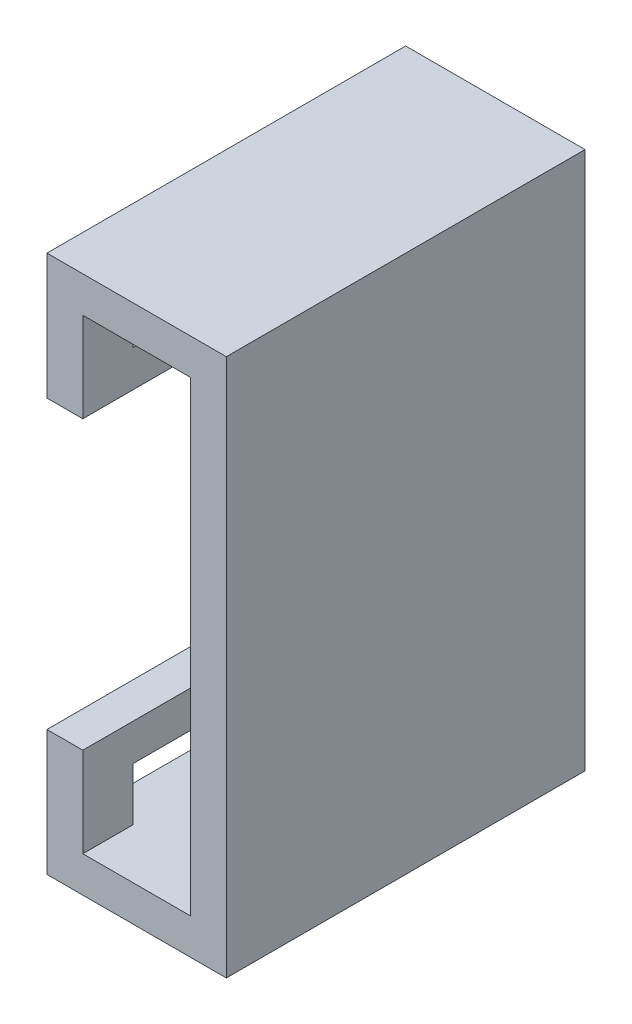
ISO-10303-21;
HEADER;
FILE_DESCRIPTION(('STEP AP214'),'2;1');
FILE_NAME('part.step','',(''),(''),'','','');
FILE_SCHEMA(('AUTOMOTIVE_DESIGN { 1 0 10303 214 1 1 1 1 }'));
ENDSEC;
DATA;
#1=APPLICATION_CONTEXT('core data for automotive mechanical design processes');
#2=APPLICATION_PROTOCOL_DEFINITION('international standard','automotive_design',2000,#1);
#3=PRODUCT_CONTEXT('',#1,'mechanical');
#4=PRODUCT('Part','Part','',(#3));
#5=PRODUCT_RELATED_PRODUCT_CATEGORY('part','',(#4));
#6=PRODUCT_DEFINITION_FORMATION('','',#4);
#7=PRODUCT_DEFINITION_CONTEXT('part definition',#1,'design');
#8=PRODUCT_DEFINITION('design','',#6,#7);
#9=PRODUCT_DEFINITION_SHAPE('','',#8);
#10=(LENGTH_UNIT() NAMED_UNIT(*) SI_UNIT(.MILLI.,.METRE.));
#11=(NAMED_UNIT(*) PLANE_ANGLE_UNIT() SI_UNIT($,.RADIAN.));
#12=(NAMED_UNIT(*) SI_UNIT($,.STERADIAN.) SOLID_ANGLE_UNIT());
#13=UNCERTAINTY_MEASURE_WITH_UNIT(LENGTH_MEASURE(1.E-05),#10,'distance_accuracy_value','');
#14=(GEOMETRIC_REPRESENTATION_CONTEXT(3) GLOBAL_UNCERTAINTY_ASSIGNED_CONTEXT((#13)) GLOBAL_UNIT_ASSIGNED_CONTEXT((#10,
#11,#12)) REPRESENTATION_CONTEXT('',''));
#15=CARTESIAN_POINT('',(0.,0.,0.));
#16=DIRECTION('',(0.,0.,1.));
#17=DIRECTION('',(1.,0.,0.));
#18=AXIS2_PLACEMENT_3D('',#15,#16,#17);
#19=CARTESIAN_POINT('',(1.,-6.5,17.));
#20=DIRECTION('',(1.,0.,0.));
#21=DIRECTION('',(0.,0.,-1.));
#22=AXIS2_PLACEMENT_3D('',#19,#20,#21);
#23=PLANE('',#22);
#24=DIRECTION('',(0.,0.,1.));
#25=VECTOR('',#24,1.);
#26=CARTESIAN_POINT('',(1.,5.02441072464,20.66470599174));
#27=LINE('',#26,#25);
#28=CARTESIAN_POINT('',(1.,5.02441072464,22.5));
#29=VERTEX_POINT('',#28);
#30=CARTESIAN_POINT('',(1.,5.02441072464,20.66470599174));
#31=VERTEX_POINT('',#30);
#32=EDGE_CURVE('E187',#29,#31,#27,.F.);
#33=ORIENTED_EDGE('',*,*,#32,.F.);
#34=DIRECTION('',(0.,1.,0.));
#35=VECTOR('',#34,1.);
#36=CARTESIAN_POINT('',(1.,0.,22.5));
#37=LINE('',#36,#35);
#38=CARTESIAN_POINT('',(1.,6.5,22.5));
#39=VERTEX_POINT('',#38);
#40=EDGE_CURVE('E220',#39,#29,#37,.F.);
#41=ORIENTED_EDGE('',*,*,#40,.F.);
#42=DIRECTION('',(0.,0.,1.));
#43=VECTOR('',#42,1.);
#44=CARTESIAN_POINT('',(1.,6.5,17.));
#45=LINE('',#44,#43);
#46=CARTESIAN_POINT('',(1.,6.5,20.66470599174));
#47=VERTEX_POINT('',#46);
#48=EDGE_CURVE('E190',#39,#47,#45,.F.);
#49=ORIENTED_EDGE('',*,*,#48,.T.);
#50=DIRECTION('',(0.,1.,0.));
#51=VECTOR('',#50,1.);
#52=CARTESIAN_POINT('',(1.,5.02441072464,20.66470599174));
#53=LINE('',#52,#51);
#54=EDGE_CURVE('E185',#47,#31,#53,.F.);
#55=ORIENTED_EDGE('',*,*,#54,.T.);
#56=EDGE_LOOP('',(#33,#41,#49,#55));
#57=FACE_BOUND('',#56,.T.);
#58=ADVANCED_FACE('F17',(#57),#23,.F.);
#59=CARTESIAN_POINT('',(1.,-6.5,17.));
#60=DIRECTION('',(1.,0.,0.));
#61=DIRECTION('',(0.,0.,-1.));
#62=AXIS2_PLACEMENT_3D('',#59,#60,#61);
#63=PLANE('',#62);
#64=DIRECTION('',(0.,1.,0.));
#65=VECTOR('',#64,1.);
#66=CARTESIAN_POINT('',(1.,5.02441072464,20.66470599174));
#67=LINE('',#66,#65);
#68=CARTESIAN_POINT('',(1.,-5.02441072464,20.66470599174));
#69=VERTEX_POINT('',#68);
#70=CARTESIAN_POINT('',(1.,-6.5,20.66470599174));
#71=VERTEX_POINT('',#70);
#72=EDGE_CURVE('E353',#69,#71,#67,.F.);
#73=ORIENTED_EDGE('',*,*,#72,.T.);
#74=DIRECTION('',(0.,0.,-1.));
#75=VECTOR('',#74,1.);
#76=CARTESIAN_POINT('',(1.,-6.5,17.));
#77=LINE('',#76,#75);
#78=CARTESIAN_POINT('',(1.,-6.5,22.5));
#79=VERTEX_POINT('',#78);
#80=EDGE_CURVE('E320',#71,#79,#77,.F.);
#81=ORIENTED_EDGE('',*,*,#80,.T.);
#82=DIRECTION('',(0.,1.,0.));
#83=VECTOR('',#82,1.);
#84=CARTESIAN_POINT('',(1.,0.,22.5));
#85=LINE('',#84,#83);
#86=CARTESIAN_POINT('',(1.,-5.02441072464,22.5));
#87=VERTEX_POINT('',#86);
#88=EDGE_CURVE('E217',#87,#79,#85,.F.);
#89=ORIENTED_EDGE('',*,*,#88,.F.);
#90=DIRECTION('',(0.,0.,1.));
#91=VECTOR('',#90,1.);
#92=CARTESIAN_POINT('',(1.,-5.02441072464,20.66470599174));
#93=LINE('',#92,#91);
#94=EDGE_CURVE('E179',#87,#69,#93,.F.);
#95=ORIENTED_EDGE('',*,*,#94,.T.);
#96=EDGE_LOOP('',(#73,#81,#89,#95));
#97=FACE_BOUND('',#96,.T.);
#98=ADVANCED_FACE('F372',(#97),#63,.F.);
#99=CARTESIAN_POINT('',(0.,0.,19.));
#100=DIRECTION('',(0.,0.,1.));
#101=DIRECTION('',(1.,0.,0.));
#102=AXIS2_PLACEMENT_3D('',#99,#100,#101);
#103=PLANE('',#102);
#104=DIRECTION('',(0.,1.,0.));
#105=VECTOR('',#104,1.);
#106=CARTESIAN_POINT('',(1.,-6.5,19.));
#107=LINE('',#106,#105);
#108=CARTESIAN_POINT('',(1.,6.5,19.));
#109=VERTEX_POINT('',#108);
#110=CARTESIAN_POINT('',(1.,-6.5,19.));
#111=VERTEX_POINT('',#110);
#112=EDGE_CURVE('E291',#109,#111,#107,.F.);
#113=ORIENTED_EDGE('',*,*,#112,.F.);
#114=DIRECTION('',(1.,0.,0.));
#115=VECTOR('',#114,1.);
#116=CARTESIAN_POINT('',(4.,6.5,19.));
#117=LINE('',#116,#115);
#118=CARTESIAN_POINT('',(4.,6.5,19.));
#119=VERTEX_POINT('',#118);
#120=EDGE_CURVE('E244',#109,#119,#117,.T.);
#121=ORIENTED_EDGE('',*,*,#120,.T.);
#122=DIRECTION('',(0.,1.,0.));
#123=VECTOR('',#122,1.);
#124=CARTESIAN_POINT('',(4.,6.5,19.));
#125=LINE('',#124,#123);
#126=CARTESIAN_POINT('',(4.,-6.5,19.));
#127=VERTEX_POINT('',#126);
#128=EDGE_CURVE('E301',#127,#119,#125,.T.);
#129=ORIENTED_EDGE('',*,*,#128,.F.);
#130=DIRECTION('',(1.,0.,0.));
#131=VECTOR('',#130,1.);
#132=CARTESIAN_POINT('',(1.,-6.5,19.));
#133=LINE('',#132,#131);
#134=EDGE_CURVE('E296',#127,#111,#133,.F.);
#135=ORIENTED_EDGE('',*,*,#134,.T.);
#136=EDGE_LOOP('',(#113,#121,#129,#135));
#137=FACE_BOUND('',#136,.T.);
#138=ADVANCED_FACE('F650',(#137),#103,.F.);
#139=CARTESIAN_POINT('',(1.5211596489,4.,27.));
#140=DIRECTION('',(0.,-1.,0.));
#141=DIRECTION('',(0.,0.,-1.));
#142=AXIS2_PLACEMENT_3D('',#139,#140,#141);
#143=PLANE('',#142);
#144=DIRECTION('',(0.,0.,-1.));
#145=VECTOR('',#144,1.);
#146=CARTESIAN_POINT('',(1.,4.,17.));
#147=LINE('',#146,#145);
#148=CARTESIAN_POINT('',(1.,4.,27.));
#149=VERTEX_POINT('',#148);
#150=CARTESIAN_POINT('',(1.,4.,22.5));
#151=VERTEX_POINT('',#150);
#152=EDGE_CURVE('E231',#149,#151,#147,.T.);
#153=ORIENTED_EDGE('',*,*,#152,.F.);
#154=DIRECTION('',(1.,0.,0.));
#155=VECTOR('',#154,1.);
#156=CARTESIAN_POINT('',(1.5211596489,4.,27.));
#157=LINE('',#156,#155);
#158=CARTESIAN_POINT('',(0.,4.,27.));
#159=VERTEX_POINT('',#158);
#160=EDGE_CURVE('E20',#149,#159,#157,.F.);
#161=ORIENTED_EDGE('',*,*,#160,.T.);
#162=DIRECTION('',(0.,0.,-1.));
#163=VECTOR('',#162,1.);
#164=CARTESIAN_POINT('',(0.,4.,17.));
#165=LINE('',#164,#163);
#166=CARTESIAN_POINT('',(0.,4.,22.5));
#167=VERTEX_POINT('',#166);
#168=EDGE_CURVE('E230',#159,#167,#165,.T.);
#169=ORIENTED_EDGE('',*,*,#168,.T.);
#170=DIRECTION('',(1.,0.,0.));
#171=VECTOR('',#170,1.);
#172=CARTESIAN_POINT('',(0.,4.,22.5));
#173=LINE('',#172,#171);
#174=EDGE_CURVE('E219',#151,#167,#173,.F.);
#175=ORIENTED_EDGE('',*,*,#174,.F.);
#176=EDGE_LOOP('',(#153,#161,#169,#175));
#177=FACE_BOUND('',#176,.T.);
#178=ADVANCED_FACE('F228',(#177),#143,.T.);
#179=CARTESIAN_POINT('',(0.,0.,22.5));
#180=DIRECTION('',(0.,0.,1.));
#181=DIRECTION('',(1.,0.,0.));
#182=AXIS2_PLACEMENT_3D('',#179,#180,#181);
#183=PLANE('',#182);
#184=ORIENTED_EDGE('',*,*,#88,.T.);
#185=DIRECTION('',(1.,0.,0.));
#186=VECTOR('',#185,1.);
#187=CARTESIAN_POINT('',(1.,-6.5,22.5));
#188=LINE('',#187,#186);
#189=CARTESIAN_POINT('',(4.,-6.5,22.5));
#190=VERTEX_POINT('',#189);
#191=EDGE_CURVE('E317',#79,#190,#188,.T.);
#192=ORIENTED_EDGE('',*,*,#191,.T.);
#193=DIRECTION('',(0.,1.,0.));
#194=VECTOR('',#193,1.);
#195=CARTESIAN_POINT('',(4.,6.5,22.5));
#196=LINE('',#195,#194);
#197=CARTESIAN_POINT('',(4.,6.5,22.5));
#198=VERTEX_POINT('',#197);
#199=EDGE_CURVE('E331',#198,#190,#196,.F.);
#200=ORIENTED_EDGE('',*,*,#199,.F.);
#201=DIRECTION('',(1.,0.,0.));
#202=VECTOR('',#201,1.);
#203=CARTESIAN_POINT('',(4.,6.5,22.5));
#204=LINE('',#203,#202);
#205=EDGE_CURVE('E337',#198,#39,#204,.F.);
#206=ORIENTED_EDGE('',*,*,#205,.T.);
#207=ORIENTED_EDGE('',*,*,#40,.T.);
#208=DIRECTION('',(0.,1.,0.));
#209=VECTOR('',#208,1.);
#210=CARTESIAN_POINT('',(1.,-6.5,22.5));
#211=LINE('',#210,#209);
#212=EDGE_CURVE('E347',#151,#29,#211,.T.);
#213=ORIENTED_EDGE('',*,*,#212,.F.);
#214=ORIENTED_EDGE('',*,*,#174,.T.);
#215=DIRECTION('',(0.,1.,0.));
#216=VECTOR('',#215,1.);
#217=CARTESIAN_POINT('',(0.,-7.5,22.5));
#218=LINE('',#217,#216);
#219=CARTESIAN_POINT('',(0.,-4.,22.5));
#220=VERTEX_POINT('',#219);
#221=EDGE_CURVE('E243',#167,#220,#218,.F.);
#222=ORIENTED_EDGE('',*,*,#221,.T.);
#223=DIRECTION('',(1.,0.,0.));
#224=VECTOR('',#223,1.);
#225=CARTESIAN_POINT('',(-0.935255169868,-4.,22.5));
#226=LINE('',#225,#224);
#227=CARTESIAN_POINT('',(1.,-4.,22.5));
#228=VERTEX_POINT('',#227);
#229=EDGE_CURVE('E215',#228,#220,#226,.F.);
#230=ORIENTED_EDGE('',*,*,#229,.F.);
#231=DIRECTION('',(0.,1.,0.));
#232=VECTOR('',#231,1.);
#233=CARTESIAN_POINT('',(1.,-6.5,22.5));
#234=LINE('',#233,#232);
#235=EDGE_CURVE('E303',#87,#228,#234,.T.);
#236=ORIENTED_EDGE('',*,*,#235,.F.);
#237=EDGE_LOOP('',(#184,#192,#200,#206,#207,#213,#214,#222,#230,#236));
#238=FACE_BOUND('',#237,.T.);
#239=ADVANCED_FACE('F375',(#238),#183,.T.);
#240=CARTESIAN_POINT('',(-0.935255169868,-4.,27.));
#241=DIRECTION('',(0.,1.,0.));
#242=DIRECTION('',(0.,0.,1.));
#243=AXIS2_PLACEMENT_3D('',#240,#241,#242);
#244=PLANE('',#243);
#245=DIRECTION('',(0.,0.,-1.));
#246=VECTOR('',#245,1.);
#247=CARTESIAN_POINT('',(0.,-4.,17.));
#248=LINE('',#247,#246);
#249=CARTESIAN_POINT('',(0.,-4.,27.));
#250=VERTEX_POINT('',#249);
#251=EDGE_CURVE('E279',#220,#250,#248,.F.);
#252=ORIENTED_EDGE('',*,*,#251,.T.);
#253=DIRECTION('',(1.,0.,0.));
#254=VECTOR('',#253,1.);
#255=CARTESIAN_POINT('',(-0.935255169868,-4.,27.));
#256=LINE('',#255,#254);
#257=CARTESIAN_POINT('',(1.,-4.,27.));
#258=VERTEX_POINT('',#257);
#259=EDGE_CURVE('E195',#250,#258,#256,.T.);
#260=ORIENTED_EDGE('',*,*,#259,.T.);
#261=DIRECTION('',(0.,0.,-1.));
#262=VECTOR('',#261,1.);
#263=CARTESIAN_POINT('',(1.,-4.,17.));
#264=LINE('',#263,#262);
#265=EDGE_CURVE('E314',#228,#258,#264,.F.);
#266=ORIENTED_EDGE('',*,*,#265,.F.);
#267=ORIENTED_EDGE('',*,*,#229,.T.);
#268=EDGE_LOOP('',(#252,#260,#266,#267));
#269=FACE_BOUND('',#268,.T.);
#270=ADVANCED_FACE('F377',(#269),#244,.T.);
#271=CARTESIAN_POINT('',(0.,6.5,25.60588645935));
#272=DIRECTION('',(0.,0.,1.));
#273=DIRECTION('',(1.,0.,0.));
#274=AXIS2_PLACEMENT_3D('',#271,#272,#273);
#275=PLANE('',#274);
#276=DIRECTION('',(1.,0.,0.));
#277=VECTOR('',#276,1.);
#278=CARTESIAN_POINT('',(0.,5.02441072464,25.60588645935));
#279=LINE('',#278,#277);
#280=CARTESIAN_POINT('',(0.,5.02441072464,25.60588645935));
#281=VERTEX_POINT('',#280);
#282=CARTESIAN_POINT('',(1.,5.02441072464,25.60588645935));
#283=VERTEX_POINT('',#282);
#284=EDGE_CURVE('E205',#281,#283,#279,.T.);
#285=ORIENTED_EDGE('',*,*,#284,.F.);
#286=DIRECTION('',(0.,1.,0.));
#287=VECTOR('',#286,1.);
#288=CARTESIAN_POINT('',(0.,-7.5,25.60588645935));
#289=LINE('',#288,#287);
#290=CARTESIAN_POINT('',(0.,6.5,25.60588645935));
#291=VERTEX_POINT('',#290);
#292=EDGE_CURVE('E276',#281,#291,#289,.T.);
#293=ORIENTED_EDGE('',*,*,#292,.T.);
#294=DIRECTION('',(1.,0.,0.));
#295=VECTOR('',#294,1.);
#296=CARTESIAN_POINT('',(4.,6.5,25.60588645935));
#297=LINE('',#296,#295);
#298=CARTESIAN_POINT('',(1.,6.5,25.60588645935));
#299=VERTEX_POINT('',#298);
#300=EDGE_CURVE('E342',#291,#299,#297,.T.);
#301=ORIENTED_EDGE('',*,*,#300,.T.);
#302=DIRECTION('',(0.,1.,0.));
#303=VECTOR('',#302,1.);
#304=CARTESIAN_POINT('',(1.,-6.5,25.60588645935));
#305=LINE('',#304,#303);
#306=EDGE_CURVE('E350',#283,#299,#305,.T.);
#307=ORIENTED_EDGE('',*,*,#306,.F.);
#308=EDGE_LOOP('',(#285,#293,#301,#307));
#309=FACE_BOUND('',#308,.T.);
#310=ADVANCED_FACE('F620',(#309),#275,.F.);
#311=CARTESIAN_POINT('',(0.,5.02441072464,20.66470599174));
#312=DIRECTION('',(0.,0.,-1.));
#313=DIRECTION('',(-1.,0.,0.));
#314=AXIS2_PLACEMENT_3D('',#311,#312,#313);
#315=PLANE('',#314);
#316=DIRECTION('',(1.,0.,0.));
#317=VECTOR('',#316,1.);
#318=CARTESIAN_POINT('',(4.,6.5,20.66470599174));
#319=LINE('',#318,#317);
#320=CARTESIAN_POINT('',(0.,6.5,20.66470599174));
#321=VERTEX_POINT('',#320);
#322=EDGE_CURVE('E345',#47,#321,#319,.F.);
#323=ORIENTED_EDGE('',*,*,#322,.T.);
#324=DIRECTION('',(0.,1.,0.));
#325=VECTOR('',#324,1.);
#326=CARTESIAN_POINT('',(0.,-7.5,20.66470599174));
#327=LINE('',#326,#325);
#328=CARTESIAN_POINT('',(0.,5.02441072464,20.66470599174));
#329=VERTEX_POINT('',#328);
#330=EDGE_CURVE('E210',#321,#329,#327,.F.);
#331=ORIENTED_EDGE('',*,*,#330,.T.);
#332=DIRECTION('',(1.,0.,0.));
#333=VECTOR('',#332,1.);
#334=CARTESIAN_POINT('',(0.,5.02441072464,20.66470599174));
#335=LINE('',#334,#333);
#336=EDGE_CURVE('E194',#31,#329,#335,.F.);
#337=ORIENTED_EDGE('',*,*,#336,.F.);
#338=ORIENTED_EDGE('',*,*,#54,.F.);
#339=EDGE_LOOP('',(#323,#331,#337,#338));
#340=FACE_BOUND('',#339,.T.);
#341=ADVANCED_FACE('F208',(#340),#315,.F.);
#342=CARTESIAN_POINT('',(0.,5.02441072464,20.66470599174));
#343=DIRECTION('',(0.,1.,0.));
#344=DIRECTION('',(0.,0.,1.));
#345=AXIS2_PLACEMENT_3D('',#342,#343,#344);
#346=PLANE('',#345);
#347=DIRECTION('',(0.,0.,-1.));
#348=VECTOR('',#347,1.);
#349=CARTESIAN_POINT('',(1.,5.02441072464,17.));
#350=LINE('',#349,#348);
#351=EDGE_CURVE('E203',#29,#283,#350,.F.);
#352=ORIENTED_EDGE('',*,*,#351,.F.);
#353=ORIENTED_EDGE('',*,*,#32,.T.);
#354=ORIENTED_EDGE('',*,*,#336,.T.);
#355=DIRECTION('',(0.,0.,-1.));
#356=VECTOR('',#355,1.);
#357=CARTESIAN_POINT('',(0.,5.02441072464,17.));
#358=LINE('',#357,#356);
#359=EDGE_CURVE('E270',#329,#281,#358,.F.);
#360=ORIENTED_EDGE('',*,*,#359,.T.);
#361=ORIENTED_EDGE('',*,*,#284,.T.);
#362=EDGE_LOOP('',(#352,#353,#354,#360,#361));
#363=FACE_BOUND('',#362,.T.);
#364=ADVANCED_FACE('F199',(#363),#346,.T.);
#365=CARTESIAN_POINT('',(0.,6.5,25.60588645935));
#366=DIRECTION('',(0.,0.,1.));
#367=DIRECTION('',(1.,0.,0.));
#368=AXIS2_PLACEMENT_3D('',#365,#366,#367);
#369=PLANE('',#368);
#370=DIRECTION('',(1.,0.,0.));
#371=VECTOR('',#370,1.);
#372=CARTESIAN_POINT('',(1.,-6.5,25.60588645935));
#373=LINE('',#372,#371);
#374=CARTESIAN_POINT('',(1.,-6.5,25.60588645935));
#375=VERTEX_POINT('',#374);
#376=CARTESIAN_POINT('',(0.,-6.5,25.60588645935));
#377=VERTEX_POINT('',#376);
#378=EDGE_CURVE('E326',#375,#377,#373,.F.);
#379=ORIENTED_EDGE('',*,*,#378,.T.);
#380=DIRECTION('',(0.,1.,0.));
#381=VECTOR('',#380,1.);
#382=CARTESIAN_POINT('',(0.,-7.5,25.60588645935));
#383=LINE('',#382,#381);
#384=CARTESIAN_POINT('',(0.,-5.02441072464,25.60588645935));
#385=VERTEX_POINT('',#384);
#386=EDGE_CURVE('E264',#377,#385,#383,.T.);
#387=ORIENTED_EDGE('',*,*,#386,.T.);
#388=DIRECTION('',(1.,0.,0.));
#389=VECTOR('',#388,1.);
#390=CARTESIAN_POINT('',(0.,-5.02441072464,25.60588645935));
#391=LINE('',#390,#389);
#392=CARTESIAN_POINT('',(1.,-5.02441072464,25.60588645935));
#393=VERTEX_POINT('',#392);
#394=EDGE_CURVE('E204',#385,#393,#391,.T.);
#395=ORIENTED_EDGE('',*,*,#394,.T.);
#396=DIRECTION('',(0.,1.,0.));
#397=VECTOR('',#396,1.);
#398=CARTESIAN_POINT('',(1.,-6.5,25.60588645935));
#399=LINE('',#398,#397);
#400=EDGE_CURVE('E309',#375,#393,#399,.T.);
#401=ORIENTED_EDGE('',*,*,#400,.F.);
#402=EDGE_LOOP('',(#379,#387,#395,#401));
#403=FACE_BOUND('',#402,.T.);
#404=ADVANCED_FACE('F363',(#403),#369,.F.);
#405=CARTESIAN_POINT('',(0.,-5.02441072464,20.66470599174));
#406=DIRECTION('',(0.,1.,0.));
#407=DIRECTION('',(0.,0.,1.));
#408=AXIS2_PLACEMENT_3D('',#405,#406,#407);
#409=PLANE('',#408);
#410=DIRECTION('',(0.,0.,-1.));
#411=VECTOR('',#410,1.);
#412=CARTESIAN_POINT('',(1.,-5.02441072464,17.));
#413=LINE('',#412,#411);
#414=EDGE_CURVE('E306',#393,#87,#413,.T.);
#415=ORIENTED_EDGE('',*,*,#414,.F.);
#416=ORIENTED_EDGE('',*,*,#394,.F.);
#417=DIRECTION('',(0.,0.,-1.));
#418=VECTOR('',#417,1.);
#419=CARTESIAN_POINT('',(0.,-5.02441072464,17.));
#420=LINE('',#419,#418);
#421=CARTESIAN_POINT('',(0.,-5.02441072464,20.66470599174));
#422=VERTEX_POINT('',#421);
#423=EDGE_CURVE('E261',#385,#422,#420,.T.);
#424=ORIENTED_EDGE('',*,*,#423,.T.);
#425=DIRECTION('',(-1.,0.,0.));
#426=VECTOR('',#425,1.);
#427=CARTESIAN_POINT('',(0.,-5.02441072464,20.66470599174));
#428=LINE('',#427,#426);
#429=EDGE_CURVE('E355',#422,#69,#428,.F.);
#430=ORIENTED_EDGE('',*,*,#429,.T.);
#431=ORIENTED_EDGE('',*,*,#94,.F.);
#432=EDGE_LOOP('',(#415,#416,#424,#430,#431));
#433=FACE_BOUND('',#432,.T.);
#434=ADVANCED_FACE('F367',(#433),#409,.F.);
#435=CARTESIAN_POINT('',(0.,5.02441072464,20.66470599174));
#436=DIRECTION('',(0.,0.,-1.));
#437=DIRECTION('',(-1.,0.,0.));
#438=AXIS2_PLACEMENT_3D('',#435,#436,#437);
#439=PLANE('',#438);
#440=ORIENTED_EDGE('',*,*,#429,.F.);
#441=DIRECTION('',(0.,1.,0.));
#442=VECTOR('',#441,1.);
#443=CARTESIAN_POINT('',(0.,-7.5,20.66470599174));
#444=LINE('',#443,#442);
#445=CARTESIAN_POINT('',(0.,-6.5,20.66470599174));
#446=VERTEX_POINT('',#445);
#447=EDGE_CURVE('E255',#422,#446,#444,.F.);
#448=ORIENTED_EDGE('',*,*,#447,.T.);
#449=DIRECTION('',(1.,0.,0.));
#450=VECTOR('',#449,1.);
#451=CARTESIAN_POINT('',(1.,-6.5,20.66470599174));
#452=LINE('',#451,#450);
#453=EDGE_CURVE('E323',#446,#71,#452,.T.);
#454=ORIENTED_EDGE('',*,*,#453,.T.);
#455=ORIENTED_EDGE('',*,*,#72,.F.);
#456=EDGE_LOOP('',(#440,#448,#454,#455));
#457=FACE_BOUND('',#456,.T.);
#458=ADVANCED_FACE('F439',(#457),#439,.F.);
#459=CARTESIAN_POINT('',(1.,-6.5,17.));
#460=DIRECTION('',(1.,0.,0.));
#461=DIRECTION('',(0.,0.,-1.));
#462=AXIS2_PLACEMENT_3D('',#459,#460,#461);
#463=PLANE('',#462);
#464=ORIENTED_EDGE('',*,*,#152,.T.);
#465=ORIENTED_EDGE('',*,*,#212,.T.);
#466=ORIENTED_EDGE('',*,*,#351,.T.);
#467=ORIENTED_EDGE('',*,*,#306,.T.);
#468=DIRECTION('',(0.,0.,1.));
#469=VECTOR('',#468,1.);
#470=CARTESIAN_POINT('',(1.,6.5,17.));
#471=LINE('',#470,#469);
#472=CARTESIAN_POINT('',(1.,6.5,27.));
#473=VERTEX_POINT('',#472);
#474=EDGE_CURVE('E339',#299,#473,#471,.T.);
#475=ORIENTED_EDGE('',*,*,#474,.T.);
#476=DIRECTION('',(0.,1.,0.));
#477=VECTOR('',#476,1.);
#478=CARTESIAN_POINT('',(1.,0.,27.));
#479=LINE('',#478,#477);
#480=EDGE_CURVE('E250',#149,#473,#479,.T.);
#481=ORIENTED_EDGE('',*,*,#480,.F.);
#482=EDGE_LOOP('',(#464,#465,#466,#467,#475,#481));
#483=FACE_BOUND('',#482,.T.);
#484=ADVANCED_FACE('F441',(#483),#463,.T.);
#485=CARTESIAN_POINT('',(4.,6.5,17.));
#486=DIRECTION('',(0.,1.,0.));
#487=DIRECTION('',(0.,0.,1.));
#488=AXIS2_PLACEMENT_3D('',#485,#486,#487);
#489=PLANE('',#488);
#490=ORIENTED_EDGE('',*,*,#205,.F.);
#491=DIRECTION('',(0.,0.,1.));
#492=VECTOR('',#491,1.);
#493=CARTESIAN_POINT('',(4.,6.5,17.));
#494=LINE('',#493,#492);
#495=CARTESIAN_POINT('',(4.,6.5,27.));
#496=VERTEX_POINT('',#495);
#497=EDGE_CURVE('E333',#496,#198,#494,.F.);
#498=ORIENTED_EDGE('',*,*,#497,.F.);
#499=DIRECTION('',(1.,0.,0.));
#500=VECTOR('',#499,1.);
#501=CARTESIAN_POINT('',(0.,6.5,27.));
#502=LINE('',#501,#500);
#503=EDGE_CURVE('E253',#473,#496,#502,.T.);
#504=ORIENTED_EDGE('',*,*,#503,.F.);
#505=ORIENTED_EDGE('',*,*,#474,.F.);
#506=ORIENTED_EDGE('',*,*,#300,.F.);
#507=DIRECTION('',(0.,0.,-1.));
#508=VECTOR('',#507,1.);
#509=CARTESIAN_POINT('',(0.,6.5,17.));
#510=LINE('',#509,#508);
#511=EDGE_CURVE('E273',#291,#321,#510,.T.);
#512=ORIENTED_EDGE('',*,*,#511,.T.);
#513=ORIENTED_EDGE('',*,*,#322,.F.);
#514=ORIENTED_EDGE('',*,*,#48,.F.);
#515=EDGE_LOOP('',(#490,#498,#504,#505,#506,#512,#513,#514));
#516=FACE_BOUND('',#515,.T.);
#517=ADVANCED_FACE('F424',(#516),#489,.F.);
#518=CARTESIAN_POINT('',(4.,6.5,17.));
#519=DIRECTION('',(-1.,0.,0.));
#520=DIRECTION('',(0.,0.,1.));
#521=AXIS2_PLACEMENT_3D('',#518,#519,#520);
#522=PLANE('',#521);
#523=ORIENTED_EDGE('',*,*,#497,.T.);
#524=ORIENTED_EDGE('',*,*,#199,.T.);
#525=DIRECTION('',(0.,0.,-1.));
#526=VECTOR('',#525,1.);
#527=CARTESIAN_POINT('',(4.,-6.5,17.));
#528=LINE('',#527,#526);
#529=CARTESIAN_POINT('',(4.,-6.5,27.));
#530=VERTEX_POINT('',#529);
#531=EDGE_CURVE('E328',#190,#530,#528,.F.);
#532=ORIENTED_EDGE('',*,*,#531,.T.);
#533=DIRECTION('',(0.,1.,0.));
#534=VECTOR('',#533,1.);
#535=CARTESIAN_POINT('',(4.,0.,27.));
#536=LINE('',#535,#534);
#537=EDGE_CURVE('E418',#496,#530,#536,.F.);
#538=ORIENTED_EDGE('',*,*,#537,.F.);
#539=EDGE_LOOP('',(#523,#524,#532,#538));
#540=FACE_BOUND('',#539,.T.);
#541=ADVANCED_FACE('F427',(#540),#522,.T.);
#542=CARTESIAN_POINT('',(1.,-6.5,17.));
#543=DIRECTION('',(0.,-1.,0.));
#544=DIRECTION('',(0.,0.,-1.));
#545=AXIS2_PLACEMENT_3D('',#542,#543,#544);
#546=PLANE('',#545);
#547=ORIENTED_EDGE('',*,*,#80,.F.);
#548=ORIENTED_EDGE('',*,*,#453,.F.);
#549=DIRECTION('',(0.,0.,-1.));
#550=VECTOR('',#549,1.);
#551=CARTESIAN_POINT('',(0.,-6.5,17.));
#552=LINE('',#551,#550);
#553=EDGE_CURVE('E267',#446,#377,#552,.F.);
#554=ORIENTED_EDGE('',*,*,#553,.T.);
#555=ORIENTED_EDGE('',*,*,#378,.F.);
#556=DIRECTION('',(0.,0.,-1.));
#557=VECTOR('',#556,1.);
#558=CARTESIAN_POINT('',(1.,-6.5,17.));
#559=LINE('',#558,#557);
#560=CARTESIAN_POINT('',(1.,-6.5,27.));
#561=VERTEX_POINT('',#560);
#562=EDGE_CURVE('E311',#561,#375,#559,.T.);
#563=ORIENTED_EDGE('',*,*,#562,.F.);
#564=DIRECTION('',(1.,0.,0.));
#565=VECTOR('',#564,1.);
#566=CARTESIAN_POINT('',(0.,-6.5,27.));
#567=LINE('',#566,#565);
#568=EDGE_CURVE('E416',#530,#561,#567,.F.);
#569=ORIENTED_EDGE('',*,*,#568,.F.);
#570=ORIENTED_EDGE('',*,*,#531,.F.);
#571=ORIENTED_EDGE('',*,*,#191,.F.);
#572=EDGE_LOOP('',(#547,#548,#554,#555,#563,#569,#570,#571));
#573=FACE_BOUND('',#572,.T.);
#574=ADVANCED_FACE('F432',(#573),#546,.F.);
#575=CARTESIAN_POINT('',(1.,-6.5,17.));
#576=DIRECTION('',(1.,0.,0.));
#577=DIRECTION('',(0.,0.,-1.));
#578=AXIS2_PLACEMENT_3D('',#575,#576,#577);
#579=PLANE('',#578);
#580=ORIENTED_EDGE('',*,*,#414,.T.);
#581=ORIENTED_EDGE('',*,*,#235,.T.);
#582=ORIENTED_EDGE('',*,*,#265,.T.);
#583=DIRECTION('',(0.,1.,0.));
#584=VECTOR('',#583,1.);
#585=CARTESIAN_POINT('',(1.,0.,27.));
#586=LINE('',#585,#584);
#587=EDGE_CURVE('E414',#561,#258,#586,.T.);
#588=ORIENTED_EDGE('',*,*,#587,.F.);
#589=ORIENTED_EDGE('',*,*,#562,.T.);
#590=ORIENTED_EDGE('',*,*,#400,.T.);
#591=EDGE_LOOP('',(#580,#581,#582,#588,#589,#590));
#592=FACE_BOUND('',#591,.T.);
#593=ADVANCED_FACE('F369',(#592),#579,.T.);
#594=CARTESIAN_POINT('',(4.,6.5,17.));
#595=DIRECTION('',(-1.,0.,0.));
#596=DIRECTION('',(0.,0.,1.));
#597=AXIS2_PLACEMENT_3D('',#594,#595,#596);
#598=PLANE('',#597);
#599=DIRECTION('',(0.,0.,-1.));
#600=VECTOR('',#599,1.);
#601=CARTESIAN_POINT('',(4.,-6.5,17.));
#602=LINE('',#601,#600);
#603=CARTESIAN_POINT('',(4.,-6.5,17.));
#604=VERTEX_POINT('',#603);
#605=EDGE_CURVE('E298',#604,#127,#602,.F.);
#606=ORIENTED_EDGE('',*,*,#605,.T.);
#607=ORIENTED_EDGE('',*,*,#128,.T.);
#608=DIRECTION('',(0.,0.,1.));
#609=VECTOR('',#608,1.);
#610=CARTESIAN_POINT('',(4.,6.5,17.));
#611=LINE('',#610,#609);
#612=CARTESIAN_POINT('',(4.,6.5,17.));
#613=VERTEX_POINT('',#612);
#614=EDGE_CURVE('E288',#119,#613,#611,.F.);
#615=ORIENTED_EDGE('',*,*,#614,.T.);
#616=DIRECTION('',(0.,1.,0.));
#617=VECTOR('',#616,1.);
#618=CARTESIAN_POINT('',(4.,0.,17.));
#619=LINE('',#618,#617);
#620=EDGE_CURVE('E403',#613,#604,#619,.F.);
#621=ORIENTED_EDGE('',*,*,#620,.T.);
#622=EDGE_LOOP('',(#606,#607,#615,#621));
#623=FACE_BOUND('',#622,.T.);
#624=ADVANCED_FACE('F484',(#623),#598,.T.);
#625=CARTESIAN_POINT('',(1.,-6.5,17.));
#626=DIRECTION('',(0.,-1.,0.));
#627=DIRECTION('',(0.,0.,-1.));
#628=AXIS2_PLACEMENT_3D('',#625,#626,#627);
#629=PLANE('',#628);
#630=ORIENTED_EDGE('',*,*,#605,.F.);
#631=DIRECTION('',(1.,0.,0.));
#632=VECTOR('',#631,1.);
#633=CARTESIAN_POINT('',(0.,-6.5,17.));
#634=LINE('',#633,#632);
#635=CARTESIAN_POINT('',(1.,-6.5,17.));
#636=VERTEX_POINT('',#635);
#637=EDGE_CURVE('E400',#604,#636,#634,.F.);
#638=ORIENTED_EDGE('',*,*,#637,.T.);
#639=DIRECTION('',(0.,0.,-1.));
#640=VECTOR('',#639,1.);
#641=CARTESIAN_POINT('',(1.,-6.5,17.));
#642=LINE('',#641,#640);
#643=EDGE_CURVE('E294',#111,#636,#642,.T.);
#644=ORIENTED_EDGE('',*,*,#643,.F.);
#645=ORIENTED_EDGE('',*,*,#134,.F.);
#646=EDGE_LOOP('',(#630,#638,#644,#645));
#647=FACE_BOUND('',#646,.T.);
#648=ADVANCED_FACE('F480',(#647),#629,.F.);
#649=CARTESIAN_POINT('',(1.,-6.5,17.));
#650=DIRECTION('',(1.,0.,0.));
#651=DIRECTION('',(0.,0.,-1.));
#652=AXIS2_PLACEMENT_3D('',#649,#650,#651);
#653=PLANE('',#652);
#654=DIRECTION('',(0.,0.,1.));
#655=VECTOR('',#654,1.);
#656=CARTESIAN_POINT('',(1.,6.5,17.));
#657=LINE('',#656,#655);
#658=CARTESIAN_POINT('',(1.,6.5,17.));
#659=VERTEX_POINT('',#658);
#660=EDGE_CURVE('E285',#659,#109,#657,.T.);
#661=ORIENTED_EDGE('',*,*,#660,.T.);
#662=ORIENTED_EDGE('',*,*,#112,.T.);
#663=ORIENTED_EDGE('',*,*,#643,.T.);
#664=DIRECTION('',(0.,1.,0.));
#665=VECTOR('',#664,1.);
#666=CARTESIAN_POINT('',(1.,0.,17.));
#667=LINE('',#666,#665);
#668=EDGE_CURVE('E397',#636,#659,#667,.T.);
#669=ORIENTED_EDGE('',*,*,#668,.T.);
#670=EDGE_LOOP('',(#661,#662,#663,#669));
#671=FACE_BOUND('',#670,.T.);
#672=ADVANCED_FACE('F476',(#671),#653,.T.);
#673=CARTESIAN_POINT('',(4.,6.5,17.));
#674=DIRECTION('',(0.,1.,0.));
#675=DIRECTION('',(0.,0.,1.));
#676=AXIS2_PLACEMENT_3D('',#673,#674,#675);
#677=PLANE('',#676);
#678=ORIENTED_EDGE('',*,*,#660,.F.);
#679=DIRECTION('',(1.,0.,0.));
#680=VECTOR('',#679,1.);
#681=CARTESIAN_POINT('',(0.,6.5,17.));
#682=LINE('',#681,#680);
#683=EDGE_CURVE('E394',#659,#613,#682,.T.);
#684=ORIENTED_EDGE('',*,*,#683,.T.);
#685=ORIENTED_EDGE('',*,*,#614,.F.);
#686=ORIENTED_EDGE('',*,*,#120,.F.);
#687=EDGE_LOOP('',(#678,#684,#685,#686));
#688=FACE_BOUND('',#687,.T.);
#689=ADVANCED_FACE('F473',(#688),#677,.F.);
#690=CARTESIAN_POINT('',(0.,-7.5,17.));
#691=DIRECTION('',(1.,0.,0.));
#692=DIRECTION('',(0.,0.,-1.));
#693=AXIS2_PLACEMENT_3D('',#690,#691,#692);
#694=PLANE('',#693);
#695=ORIENTED_EDGE('',*,*,#423,.F.);
#696=ORIENTED_EDGE('',*,*,#386,.F.);
#697=ORIENTED_EDGE('',*,*,#553,.F.);
#698=ORIENTED_EDGE('',*,*,#447,.F.);
#699=EDGE_LOOP('',(#695,#696,#697,#698));
#700=FACE_BOUND('',#699,.T.);
#701=ORIENTED_EDGE('',*,*,#330,.F.);
#702=ORIENTED_EDGE('',*,*,#511,.F.);
#703=ORIENTED_EDGE('',*,*,#292,.F.);
#704=ORIENTED_EDGE('',*,*,#359,.F.);
#705=EDGE_LOOP('',(#701,#702,#703,#704));
#706=FACE_BOUND('',#705,.T.);
#707=ORIENTED_EDGE('',*,*,#221,.F.);
#708=ORIENTED_EDGE('',*,*,#168,.F.);
#709=DIRECTION('',(0.,1.,0.));
#710=VECTOR('',#709,1.);
#711=CARTESIAN_POINT('',(0.,0.,27.));
#712=LINE('',#711,#710);
#713=CARTESIAN_POINT('',(0.,7.5,27.));
#714=VERTEX_POINT('',#713);
#715=EDGE_CURVE('E239',#714,#159,#712,.F.);
#716=ORIENTED_EDGE('',*,*,#715,.F.);
#717=DIRECTION('',(0.,0.,1.));
#718=VECTOR('',#717,1.);
#719=CARTESIAN_POINT('',(0.,7.5,17.));
#720=LINE('',#719,#718);
#721=CARTESIAN_POINT('',(0.,7.5,17.));
#722=VERTEX_POINT('',#721);
#723=EDGE_CURVE('E412',#722,#714,#720,.T.);
#724=ORIENTED_EDGE('',*,*,#723,.F.);
#725=DIRECTION('',(0.,1.,0.));
#726=VECTOR('',#725,1.);
#727=CARTESIAN_POINT('',(0.,0.,17.));
#728=LINE('',#727,#726);
#729=CARTESIAN_POINT('',(0.,-7.5,17.));
#730=VERTEX_POINT('',#729);
#731=EDGE_CURVE('E406',#722,#730,#728,.F.);
#732=ORIENTED_EDGE('',*,*,#731,.T.);
#733=DIRECTION('',(0.,0.,-1.));
#734=VECTOR('',#733,1.);
#735=CARTESIAN_POINT('',(0.,-7.5,17.));
#736=LINE('',#735,#734);
#737=CARTESIAN_POINT('',(0.,-7.5,27.));
#738=VERTEX_POINT('',#737);
#739=EDGE_CURVE('E381',#738,#730,#736,.T.);
#740=ORIENTED_EDGE('',*,*,#739,.F.);
#741=DIRECTION('',(0.,1.,0.));
#742=VECTOR('',#741,1.);
#743=CARTESIAN_POINT('',(0.,0.,27.));
#744=LINE('',#743,#742);
#745=EDGE_CURVE('E251',#250,#738,#744,.F.);
#746=ORIENTED_EDGE('',*,*,#745,.F.);
#747=ORIENTED_EDGE('',*,*,#251,.F.);
#748=EDGE_LOOP('',(#707,#708,#716,#724,#732,#740,#746,#747));
#749=FACE_BOUND('',#748,.T.);
#750=ADVANCED_FACE('F238',(#700,#706,#749),#694,.F.);
#751=CARTESIAN_POINT('',(0.,0.,27.));
#752=DIRECTION('',(0.,0.,1.));
#753=DIRECTION('',(1.,0.,0.));
#754=AXIS2_PLACEMENT_3D('',#751,#752,#753);
#755=PLANE('',#754);
#756=ORIENTED_EDGE('',*,*,#587,.T.);
#757=ORIENTED_EDGE('',*,*,#259,.F.);
#758=ORIENTED_EDGE('',*,*,#745,.T.);
#759=DIRECTION('',(1.,0.,0.));
#760=VECTOR('',#759,1.);
#761=CARTESIAN_POINT('',(0.,-7.5,27.));
#762=LINE('',#761,#760);
#763=CARTESIAN_POINT('',(5.,-7.5,27.));
#764=VERTEX_POINT('',#763);
#765=EDGE_CURVE('E384',#764,#738,#762,.F.);
#766=ORIENTED_EDGE('',*,*,#765,.F.);
#767=DIRECTION('',(0.,1.,0.));
#768=VECTOR('',#767,1.);
#769=CARTESIAN_POINT('',(5.,7.5,27.));
#770=LINE('',#769,#768);
#771=CARTESIAN_POINT('',(5.,7.5,27.));
#772=VERTEX_POINT('',#771);
#773=EDGE_CURVE('E386',#764,#772,#770,.T.);
#774=ORIENTED_EDGE('',*,*,#773,.T.);
#775=DIRECTION('',(1.,0.,0.));
#776=VECTOR('',#775,1.);
#777=CARTESIAN_POINT('',(5.,7.5,27.));
#778=LINE('',#777,#776);
#779=EDGE_CURVE('E249',#714,#772,#778,.T.);
#780=ORIENTED_EDGE('',*,*,#779,.F.);
#781=ORIENTED_EDGE('',*,*,#715,.T.);
#782=ORIENTED_EDGE('',*,*,#160,.F.);
#783=ORIENTED_EDGE('',*,*,#480,.T.);
#784=ORIENTED_EDGE('',*,*,#503,.T.);
#785=ORIENTED_EDGE('',*,*,#537,.T.);
#786=ORIENTED_EDGE('',*,*,#568,.T.);
#787=EDGE_LOOP('',(#756,#757,#758,#766,#774,#780,#781,#782,#783,#784,#785,#786));
#788=FACE_BOUND('',#787,.T.);
#789=ADVANCED_FACE('F247',(#788),#755,.T.);
#790=CARTESIAN_POINT('',(5.,7.5,17.));
#791=DIRECTION('',(0.,1.,0.));
#792=DIRECTION('',(0.,0.,1.));
#793=AXIS2_PLACEMENT_3D('',#790,#791,#792);
#794=PLANE('',#793);
#795=ORIENTED_EDGE('',*,*,#723,.T.);
#796=ORIENTED_EDGE('',*,*,#779,.T.);
#797=DIRECTION('',(0.,0.,1.));
#798=VECTOR('',#797,1.);
#799=CARTESIAN_POINT('',(5.,7.5,17.));
#800=LINE('',#799,#798);
#801=CARTESIAN_POINT('',(5.,7.5,17.));
#802=VERTEX_POINT('',#801);
#803=EDGE_CURVE('E388',#772,#802,#800,.F.);
#804=ORIENTED_EDGE('',*,*,#803,.T.);
#805=DIRECTION('',(1.,0.,0.));
#806=VECTOR('',#805,1.);
#807=CARTESIAN_POINT('',(0.,7.5,17.));
#808=LINE('',#807,#806);
#809=EDGE_CURVE('E408',#802,#722,#808,.F.);
#810=ORIENTED_EDGE('',*,*,#809,.T.);
#811=EDGE_LOOP('',(#795,#796,#804,#810));
#812=FACE_BOUND('',#811,.T.);
#813=ADVANCED_FACE('F464',(#812),#794,.T.);
#814=CARTESIAN_POINT('',(0.,0.,17.));
#815=DIRECTION('',(0.,0.,1.));
#816=DIRECTION('',(1.,0.,0.));
#817=AXIS2_PLACEMENT_3D('',#814,#815,#816);
#818=PLANE('',#817);
#819=ORIENTED_EDGE('',*,*,#668,.F.);
#820=ORIENTED_EDGE('',*,*,#637,.F.);
#821=ORIENTED_EDGE('',*,*,#620,.F.);
#822=ORIENTED_EDGE('',*,*,#683,.F.);
#823=EDGE_LOOP('',(#819,#820,#821,#822));
#824=FACE_BOUND('',#823,.T.);
#825=DIRECTION('',(1.,0.,0.));
#826=VECTOR('',#825,1.);
#827=CARTESIAN_POINT('',(0.,-7.5,17.));
#828=LINE('',#827,#826);
#829=CARTESIAN_POINT('',(5.,-7.5,17.));
#830=VERTEX_POINT('',#829);
#831=EDGE_CURVE('E34',#730,#830,#828,.T.);
#832=ORIENTED_EDGE('',*,*,#831,.F.);
#833=ORIENTED_EDGE('',*,*,#731,.F.);
#834=ORIENTED_EDGE('',*,*,#809,.F.);
#835=DIRECTION('',(0.,1.,0.));
#836=VECTOR('',#835,1.);
#837=CARTESIAN_POINT('',(5.,7.5,17.));
#838=LINE('',#837,#836);
#839=EDGE_CURVE('E26',#802,#830,#838,.F.);
#840=ORIENTED_EDGE('',*,*,#839,.T.);
#841=EDGE_LOOP('',(#832,#833,#834,#840));
#842=FACE_BOUND('',#841,.T.);
#843=ADVANCED_FACE('F458',(#824,#842),#818,.F.);
#844=CARTESIAN_POINT('',(0.,-7.5,17.));
#845=DIRECTION('',(0.,-1.,0.));
#846=DIRECTION('',(0.,0.,-1.));
#847=AXIS2_PLACEMENT_3D('',#844,#845,#846);
#848=PLANE('',#847);
#849=DIRECTION('',(0.,0.,1.));
#850=VECTOR('',#849,1.);
#851=CARTESIAN_POINT('',(5.,-7.5,17.));
#852=LINE('',#851,#850);
#853=EDGE_CURVE('E11',#830,#764,#852,.T.);
#854=ORIENTED_EDGE('',*,*,#853,.T.);
#855=ORIENTED_EDGE('',*,*,#765,.T.);
#856=ORIENTED_EDGE('',*,*,#739,.T.);
#857=ORIENTED_EDGE('',*,*,#831,.T.);
#858=EDGE_LOOP('',(#854,#855,#856,#857));
#859=FACE_BOUND('',#858,.T.);
#860=ADVANCED_FACE('F385',(#859),#848,.T.);
#861=CARTESIAN_POINT('',(5.,7.5,17.));
#862=DIRECTION('',(-1.,0.,0.));
#863=DIRECTION('',(0.,0.,1.));
#864=AXIS2_PLACEMENT_3D('',#861,#862,#863);
#865=PLANE('',#864);
#866=ORIENTED_EDGE('',*,*,#839,.F.);
#867=ORIENTED_EDGE('',*,*,#803,.F.);
#868=ORIENTED_EDGE('',*,*,#773,.F.);
#869=ORIENTED_EDGE('',*,*,#853,.F.);
#870=EDGE_LOOP('',(#866,#867,#868,#869));
#871=FACE_BOUND('',#870,.T.);
#872=ADVANCED_FACE('F451',(#871),#865,.F.);
#873=CLOSED_SHELL('',(#58,#98,#138,#178,#239,#270,#310,#341,#364,#404,#434,#458,#484,#517,#541,
#574,#593,#624,#648,#672,#689,#750,#789,#813,#843,#860,#872));
#874=MANIFOLD_SOLID_BREP('B1',#873);
#875=ADVANCED_BREP_SHAPE_REPRESENTATION('',(#18,#874),#14);
#876=SHAPE_DEFINITION_REPRESENTATION(#9,#875);
ENDSEC;
END-ISO-10303-21;
